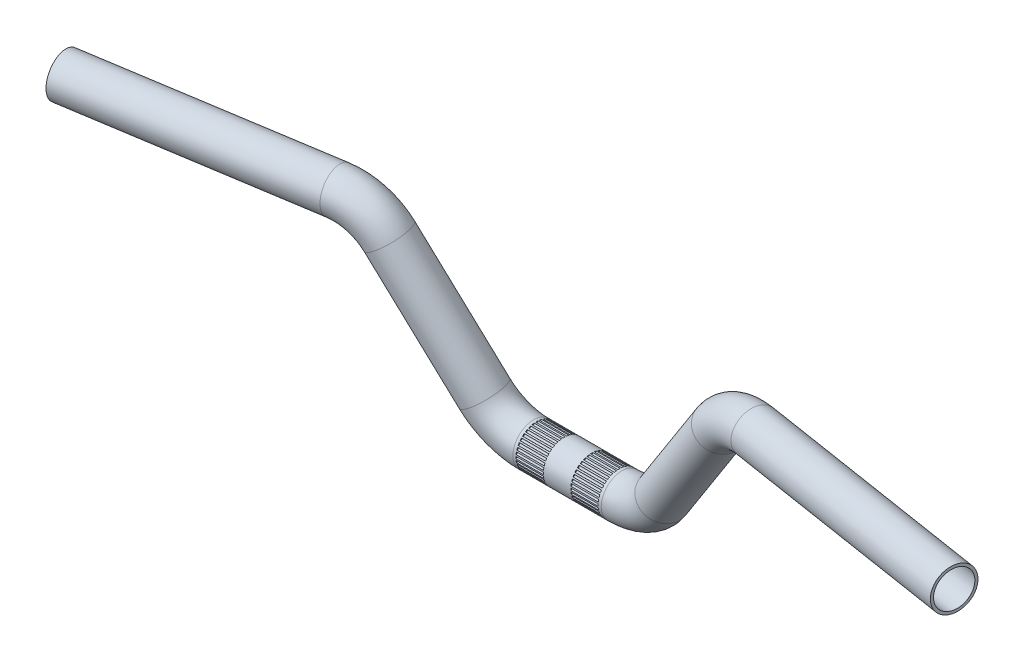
from build123d import *

# Parameters (mm, degrees)
SKETCH5_R                = 19
SKETCH5_R_2              = 16.5
CUT_EXTRUDE1_START       = -12.5
SKETCH6_R                = 1
CUT_EXTRUDE1_DEPTH       = 25
CIRPATTERN1_COUNT        = 36
MIRROR2_START            = -12.5
MIRROR2_COPY_1_SKETCH_R  = 1
MIRROR2_COPY_1_DEPTH     = 25
MIRROR2_COPY_2_SKETCH_R  = 1
MIRROR2_COPY_2_DEPTH     = 25
MIRROR2_COPY_3_SKETCH_R  = 1
MIRROR2_COPY_3_DEPTH     = 25
MIRROR2_COPY_4_SKETCH_R  = 1
MIRROR2_COPY_4_DEPTH     = 25
MIRROR2_COPY_5_SKETCH_R  = 1
MIRROR2_COPY_5_DEPTH     = 25
MIRROR2_COPY_6_SKETCH_R  = 1
MIRROR2_COPY_6_DEPTH     = 25
MIRROR2_COPY_7_SKETCH_R  = 1
MIRROR2_COPY_7_DEPTH     = 25
MIRROR2_COPY_8_SKETCH_R  = 1
MIRROR2_COPY_8_DEPTH     = 25
MIRROR2_COPY_9_SKETCH_R  = 1
MIRROR2_COPY_9_DEPTH     = 25
MIRROR2_COPY_10_SKETCH_R = 1
MIRROR2_COPY_10_DEPTH    = 25
MIRROR2_COPY_11_SKETCH_R = 1
MIRROR2_COPY_11_DEPTH    = 25
MIRROR2_COPY_12_SKETCH_R = 1
MIRROR2_COPY_12_DEPTH    = 25
MIRROR2_COPY_13_SKETCH_R = 1
MIRROR2_COPY_13_DEPTH    = 25
MIRROR2_COPY_14_SKETCH_R = 1
MIRROR2_COPY_14_DEPTH    = 25
MIRROR2_COPY_15_SKETCH_R = 1
MIRROR2_COPY_15_DEPTH    = 25
MIRROR2_COPY_16_SKETCH_R = 1
MIRROR2_COPY_16_DEPTH    = 25
MIRROR2_COPY_17_SKETCH_R = 1
MIRROR2_COPY_17_DEPTH    = 25
MIRROR2_COPY_18_SKETCH_R = 1
MIRROR2_COPY_18_DEPTH    = 25
MIRROR2_COPY_19_SKETCH_R = 1
MIRROR2_COPY_19_DEPTH    = 25
MIRROR2_COPY_20_SKETCH_R = 1
MIRROR2_COPY_20_DEPTH    = 25
MIRROR2_COPY_21_SKETCH_R = 1
MIRROR2_COPY_21_DEPTH    = 25
MIRROR2_COPY_22_SKETCH_R = 1
MIRROR2_COPY_22_DEPTH    = 25
MIRROR2_COPY_23_SKETCH_R = 1
MIRROR2_COPY_23_DEPTH    = 25
MIRROR2_COPY_24_SKETCH_R = 1
MIRROR2_COPY_24_DEPTH    = 25
MIRROR2_COPY_25_SKETCH_R = 1
MIRROR2_COPY_25_DEPTH    = 25
MIRROR2_COPY_26_SKETCH_R = 1
MIRROR2_COPY_26_DEPTH    = 25
MIRROR2_COPY_27_SKETCH_R = 1
MIRROR2_COPY_27_DEPTH    = 25
MIRROR2_COPY_28_SKETCH_R = 1
MIRROR2_COPY_28_DEPTH    = 25
MIRROR2_COPY_29_SKETCH_R = 1
MIRROR2_COPY_29_DEPTH    = 25
MIRROR2_COPY_30_SKETCH_R = 1
MIRROR2_COPY_30_DEPTH    = 25
MIRROR2_COPY_31_SKETCH_R = 1
MIRROR2_COPY_31_DEPTH    = 25
MIRROR2_COPY_32_SKETCH_R = 1
MIRROR2_COPY_32_DEPTH    = 25
MIRROR2_COPY_33_SKETCH_R = 1
MIRROR2_COPY_33_DEPTH    = 25
MIRROR2_COPY_34_SKETCH_R = 1
MIRROR2_COPY_34_DEPTH    = 25
MIRROR2_COPY_35_SKETCH_R = 1
MIRROR2_COPY_35_DEPTH    = 25


with BuildPart() as part:
    # Sweep-Thin1: sweep along a curve in space
    with BuildLine() as sweep_thin1_path:
        Line((0, 0, 0), (40.257242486, 0, 0))
        ThreePointArc((81.352690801, 21.183952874, 3.782848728), (63.451561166, 5.616419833, 1.002932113), (40.257242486, 0, 0))
        Line((81.352690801, 21.183952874, 3.782848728), (150.430291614, 119.304592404, 21.304391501))
        ThreePointArc((190.265845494, 140, 28.98382626), (167.829257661, 134.52581433, 25.076237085), (150.430291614, 119.304592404, 21.304391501))
        Line((190.265845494, 140, 28.98382626), (406, 140, 63))
    # Sketch5 → Sweep-Thin1 (sweep)
    with BuildSketch(Plane(origin=(0, 0, 0), x_dir=(0, 0, -1), z_dir=(1, 0, 0))):
        Circle(SKETCH5_R)
        Circle(SKETCH5_R_2, mode=Mode.SUBTRACT)
    sweep_thin1 = sweep(path=sweep_thin1_path.line)

    # Mirror1: Sweep-Thin1 across plane
    add(sweep_thin1.mirror(Plane(origin=(0, 0, 0), x_dir=(0, 0, 1), z_dir=(1, 0, 0))))

    # Sketch6 → Cut-Extrude1 (cut)
    with BuildSketch(Plane(origin=(0, 0, 0), x_dir=(0, 0, -1), z_dir=(1, 0, 0)).offset(CUT_EXTRUDE1_START)):
        with Locations((0, -19)):
            Circle(SKETCH6_R)
    cut_extrude1 = extrude(amount=-CUT_EXTRUDE1_DEPTH, mode=Mode.SUBTRACT)

    # CirPattern1: Cut-Extrude1 ×36 about axis
    cirpattern1_axis = Axis((0, 0, 0), (1, 0, 0))
    for i in range(1, CIRPATTERN1_COUNT):
        add(cut_extrude1.rotate(cirpattern1_axis, i * 360 / CIRPATTERN1_COUNT), mode=Mode.SUBTRACT)

    # Mirror2: Cut-Extrude1 across plane
    add(cut_extrude1.mirror(Plane(origin=(0, 0, 0), x_dir=(0, 0, 1), z_dir=(1, 0, 0))), mode=Mode.SUBTRACT)

    # Mirror2 copy 1 sketch → Mirror2 copy 1 (cut)
    with BuildSketch(Plane(origin=(0, 0, 0), x_dir=(0, 0.17364817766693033, -0.984807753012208), z_dir=(-1, 0, 0)).offset(MIRROR2_START)):
        with Locations((0, 19)):
            Circle(MIRROR2_COPY_1_SKETCH_R)
    extrude(amount=-MIRROR2_COPY_1_DEPTH, mode=Mode.SUBTRACT)

    # Mirror2 copy 2 sketch → Mirror2 copy 2 (cut)
    with BuildSketch(Plane(origin=(0, 0, 0), x_dir=(0, 0.3420201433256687, -0.9396926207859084), z_dir=(-1, 0, 0)).offset(MIRROR2_START)):
        with Locations((0, 19)):
            Circle(MIRROR2_COPY_2_SKETCH_R)
    extrude(amount=-MIRROR2_COPY_2_DEPTH, mode=Mode.SUBTRACT)

    # Mirror2 copy 3 sketch → Mirror2 copy 3 (cut)
    with BuildSketch(Plane(origin=(0, 0, 0), x_dir=(0, 0.49999999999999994, -0.8660254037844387), z_dir=(-1, 0, 0)).offset(MIRROR2_START)):
        with Locations((0, 19)):
            Circle(MIRROR2_COPY_3_SKETCH_R)
    extrude(amount=-MIRROR2_COPY_3_DEPTH, mode=Mode.SUBTRACT)

    # Mirror2 copy 4 sketch → Mirror2 copy 4 (cut)
    with BuildSketch(Plane(origin=(0, 0, 0), x_dir=(0, 0.6427876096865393, -0.766044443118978), z_dir=(-1, 0, 0)).offset(MIRROR2_START)):
        with Locations((0, 19)):
            Circle(MIRROR2_COPY_4_SKETCH_R)
    extrude(amount=-MIRROR2_COPY_4_DEPTH, mode=Mode.SUBTRACT)

    # Mirror2 copy 5 sketch → Mirror2 copy 5 (cut)
    with BuildSketch(Plane(origin=(0, 0, 0), x_dir=(0, 0.766044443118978, -0.6427876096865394), z_dir=(-1, 0, 0)).offset(MIRROR2_START)):
        with Locations((0, 19)):
            Circle(MIRROR2_COPY_5_SKETCH_R)
    extrude(amount=-MIRROR2_COPY_5_DEPTH, mode=Mode.SUBTRACT)

    # Mirror2 copy 6 sketch → Mirror2 copy 6 (cut)
    with BuildSketch(Plane(origin=(0, 0, 0), x_dir=(0, 0.8660254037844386, -0.5000000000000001), z_dir=(-1, 0, 0)).offset(MIRROR2_START)):
        with Locations((0, 19)):
            Circle(MIRROR2_COPY_6_SKETCH_R)
    extrude(amount=-MIRROR2_COPY_6_DEPTH, mode=Mode.SUBTRACT)

    # Mirror2 copy 7 sketch → Mirror2 copy 7 (cut)
    with BuildSketch(Plane(origin=(0, 0, 0), x_dir=(0, 0.9396926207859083, -0.3420201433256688), z_dir=(-1, 0, 0)).offset(MIRROR2_START)):
        with Locations((0, 19)):
            Circle(MIRROR2_COPY_7_SKETCH_R)
    extrude(amount=-MIRROR2_COPY_7_DEPTH, mode=Mode.SUBTRACT)

    # Mirror2 copy 8 sketch → Mirror2 copy 8 (cut)
    with BuildSketch(Plane(origin=(0, 0, 0), x_dir=(0, 0.984807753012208, -0.17364817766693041), z_dir=(-1, 0, 0)).offset(MIRROR2_START)):
        with Locations((0, 19)):
            Circle(MIRROR2_COPY_8_SKETCH_R)
    extrude(amount=-MIRROR2_COPY_8_DEPTH, mode=Mode.SUBTRACT)

    # Mirror2 copy 9 sketch → Mirror2 copy 9 (cut)
    with BuildSketch(Plane(origin=(0, 0, 0), x_dir=(0, 1, 0), z_dir=(-1, 0, 0)).offset(MIRROR2_START)):
        with Locations((0, 19)):
            Circle(MIRROR2_COPY_9_SKETCH_R)
    extrude(amount=-MIRROR2_COPY_9_DEPTH, mode=Mode.SUBTRACT)

    # Mirror2 copy 10 sketch → Mirror2 copy 10 (cut)
    with BuildSketch(Plane(origin=(0, 0, 0), x_dir=(0, 0.984807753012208, 0.1736481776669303), z_dir=(-1, 0, 0)).offset(MIRROR2_START)):
        with Locations((0, 19)):
            Circle(MIRROR2_COPY_10_SKETCH_R)
    extrude(amount=-MIRROR2_COPY_10_DEPTH, mode=Mode.SUBTRACT)

    # Mirror2 copy 11 sketch → Mirror2 copy 11 (cut)
    with BuildSketch(Plane(origin=(0, 0, 0), x_dir=(0, 0.9396926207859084, 0.3420201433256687), z_dir=(-1, 0, 0)).offset(MIRROR2_START)):
        with Locations((0, 19)):
            Circle(MIRROR2_COPY_11_SKETCH_R)
    extrude(amount=-MIRROR2_COPY_11_DEPTH, mode=Mode.SUBTRACT)

    # Mirror2 copy 12 sketch → Mirror2 copy 12 (cut)
    with BuildSketch(Plane(origin=(0, 0, 0), x_dir=(0, 0.8660254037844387, 0.4999999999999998), z_dir=(-1, 0, 0)).offset(MIRROR2_START)):
        with Locations((0, 19)):
            Circle(MIRROR2_COPY_12_SKETCH_R)
    extrude(amount=-MIRROR2_COPY_12_DEPTH, mode=Mode.SUBTRACT)

    # Mirror2 copy 13 sketch → Mirror2 copy 13 (cut)
    with BuildSketch(Plane(origin=(0, 0, 0), x_dir=(0, 0.766044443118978, 0.6427876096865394), z_dir=(-1, 0, 0)).offset(MIRROR2_START)):
        with Locations((0, 19)):
            Circle(MIRROR2_COPY_13_SKETCH_R)
    extrude(amount=-MIRROR2_COPY_13_DEPTH, mode=Mode.SUBTRACT)

    # Mirror2 copy 14 sketch → Mirror2 copy 14 (cut)
    with BuildSketch(Plane(origin=(0, 0, 0), x_dir=(0, 0.6427876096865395, 0.7660444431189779), z_dir=(-1, 0, 0)).offset(MIRROR2_START)):
        with Locations((0, 19)):
            Circle(MIRROR2_COPY_14_SKETCH_R)
    extrude(amount=-MIRROR2_COPY_14_DEPTH, mode=Mode.SUBTRACT)

    # Mirror2 copy 15 sketch → Mirror2 copy 15 (cut)
    with BuildSketch(Plane(origin=(0, 0, 0), x_dir=(0, 0.49999999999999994, 0.8660254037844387), z_dir=(-1, 0, 0)).offset(MIRROR2_START)):
        with Locations((0, 19)):
            Circle(MIRROR2_COPY_15_SKETCH_R)
    extrude(amount=-MIRROR2_COPY_15_DEPTH, mode=Mode.SUBTRACT)

    # Mirror2 copy 16 sketch → Mirror2 copy 16 (cut)
    with BuildSketch(Plane(origin=(0, 0, 0), x_dir=(0, 0.3420201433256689, 0.9396926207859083), z_dir=(-1, 0, 0)).offset(MIRROR2_START)):
        with Locations((0, 19)):
            Circle(MIRROR2_COPY_16_SKETCH_R)
    extrude(amount=-MIRROR2_COPY_16_DEPTH, mode=Mode.SUBTRACT)

    # Mirror2 copy 17 sketch → Mirror2 copy 17 (cut)
    with BuildSketch(Plane(origin=(0, 0, 0), x_dir=(0, 0.17364817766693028, 0.984807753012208), z_dir=(-1, 0, 0)).offset(MIRROR2_START)):
        with Locations((0, 19)):
            Circle(MIRROR2_COPY_17_SKETCH_R)
    extrude(amount=-MIRROR2_COPY_17_DEPTH, mode=Mode.SUBTRACT)

    # Mirror2 copy 18 sketch → Mirror2 copy 18 (cut)
    with BuildSketch(Plane.ZY.offset(MIRROR2_START)):
        with Locations((0, 19)):
            Circle(MIRROR2_COPY_18_SKETCH_R)
    extrude(amount=-MIRROR2_COPY_18_DEPTH, mode=Mode.SUBTRACT)

    # Mirror2 copy 19 sketch → Mirror2 copy 19 (cut)
    with BuildSketch(Plane(origin=(0, 0, 0), x_dir=(0, -0.17364817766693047, 0.984807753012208), z_dir=(-1, 0, 0)).offset(MIRROR2_START)):
        with Locations((0, 19)):
            Circle(MIRROR2_COPY_19_SKETCH_R)
    extrude(amount=-MIRROR2_COPY_19_DEPTH, mode=Mode.SUBTRACT)

    # Mirror2 copy 20 sketch → Mirror2 copy 20 (cut)
    with BuildSketch(Plane(origin=(0, 0, 0), x_dir=(0, -0.34202014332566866, 0.9396926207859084), z_dir=(-1, 0, 0)).offset(MIRROR2_START)):
        with Locations((0, 19)):
            Circle(MIRROR2_COPY_20_SKETCH_R)
    extrude(amount=-MIRROR2_COPY_20_DEPTH, mode=Mode.SUBTRACT)

    # Mirror2 copy 21 sketch → Mirror2 copy 21 (cut)
    with BuildSketch(Plane(origin=(0, 0, 0), x_dir=(0, -0.5000000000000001, 0.8660254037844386), z_dir=(-1, 0, 0)).offset(MIRROR2_START)):
        with Locations((0, 19)):
            Circle(MIRROR2_COPY_21_SKETCH_R)
    extrude(amount=-MIRROR2_COPY_21_DEPTH, mode=Mode.SUBTRACT)

    # Mirror2 copy 22 sketch → Mirror2 copy 22 (cut)
    with BuildSketch(Plane(origin=(0, 0, 0), x_dir=(0, -0.6427876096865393, 0.766044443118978), z_dir=(-1, 0, 0)).offset(MIRROR2_START)):
        with Locations((0, 19)):
            Circle(MIRROR2_COPY_22_SKETCH_R)
    extrude(amount=-MIRROR2_COPY_22_DEPTH, mode=Mode.SUBTRACT)

    # Mirror2 copy 23 sketch → Mirror2 copy 23 (cut)
    with BuildSketch(Plane(origin=(0, 0, 0), x_dir=(0, -0.7660444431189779, 0.6427876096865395), z_dir=(-1, 0, 0)).offset(MIRROR2_START)):
        with Locations((0, 19)):
            Circle(MIRROR2_COPY_23_SKETCH_R)
    extrude(amount=-MIRROR2_COPY_23_DEPTH, mode=Mode.SUBTRACT)

    # Mirror2 copy 24 sketch → Mirror2 copy 24 (cut)
    with BuildSketch(Plane(origin=(0, 0, 0), x_dir=(0, -0.8660254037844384, 0.5000000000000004), z_dir=(-1, 0, 0)).offset(MIRROR2_START)):
        with Locations((0, 19)):
            Circle(MIRROR2_COPY_24_SKETCH_R)
    extrude(amount=-MIRROR2_COPY_24_DEPTH, mode=Mode.SUBTRACT)

    # Mirror2 copy 25 sketch → Mirror2 copy 25 (cut)
    with BuildSketch(Plane(origin=(0, 0, 0), x_dir=(0, -0.9396926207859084, 0.34202014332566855), z_dir=(-1, 0, 0)).offset(MIRROR2_START)):
        with Locations((0, 19)):
            Circle(MIRROR2_COPY_25_SKETCH_R)
    extrude(amount=-MIRROR2_COPY_25_DEPTH, mode=Mode.SUBTRACT)

    # Mirror2 copy 26 sketch → Mirror2 copy 26 (cut)
    with BuildSketch(Plane(origin=(0, 0, 0), x_dir=(0, -0.984807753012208, 0.17364817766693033), z_dir=(-1, 0, 0)).offset(MIRROR2_START)):
        with Locations((0, 19)):
            Circle(MIRROR2_COPY_26_SKETCH_R)
    extrude(amount=-MIRROR2_COPY_26_DEPTH, mode=Mode.SUBTRACT)

    # Mirror2 copy 27 sketch → Mirror2 copy 27 (cut)
    with BuildSketch(Plane(origin=(0, 0, 0), x_dir=(0, -1, 0), z_dir=(-1, 0, 0)).offset(MIRROR2_START)):
        with Locations((0, 19)):
            Circle(MIRROR2_COPY_27_SKETCH_R)
    extrude(amount=-MIRROR2_COPY_27_DEPTH, mode=Mode.SUBTRACT)

    # Mirror2 copy 28 sketch → Mirror2 copy 28 (cut)
    with BuildSketch(Plane(origin=(0, 0, 0), x_dir=(0, -0.9848077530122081, -0.17364817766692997), z_dir=(-1, 0, 0)).offset(MIRROR2_START)):
        with Locations((0, 19)):
            Circle(MIRROR2_COPY_28_SKETCH_R)
    extrude(amount=-MIRROR2_COPY_28_DEPTH, mode=Mode.SUBTRACT)

    # Mirror2 copy 29 sketch → Mirror2 copy 29 (cut)
    with BuildSketch(Plane(origin=(0, 0, 0), x_dir=(0, -0.9396926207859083, -0.342020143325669), z_dir=(-1, 0, 0)).offset(MIRROR2_START)):
        with Locations((0, 19)):
            Circle(MIRROR2_COPY_29_SKETCH_R)
    extrude(amount=-MIRROR2_COPY_29_DEPTH, mode=Mode.SUBTRACT)

    # Mirror2 copy 30 sketch → Mirror2 copy 30 (cut)
    with BuildSketch(Plane(origin=(0, 0, 0), x_dir=(0, -0.8660254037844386, -0.5000000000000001), z_dir=(-1, 0, 0)).offset(MIRROR2_START)):
        with Locations((0, 19)):
            Circle(MIRROR2_COPY_30_SKETCH_R)
    extrude(amount=-MIRROR2_COPY_30_DEPTH, mode=Mode.SUBTRACT)

    # Mirror2 copy 31 sketch → Mirror2 copy 31 (cut)
    with BuildSketch(Plane(origin=(0, 0, 0), x_dir=(0, -0.7660444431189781, -0.6427876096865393), z_dir=(-1, 0, 0)).offset(MIRROR2_START)):
        with Locations((0, 19)):
            Circle(MIRROR2_COPY_31_SKETCH_R)
    extrude(amount=-MIRROR2_COPY_31_DEPTH, mode=Mode.SUBTRACT)

    # Mirror2 copy 32 sketch → Mirror2 copy 32 (cut)
    with BuildSketch(Plane(origin=(0, 0, 0), x_dir=(0, -0.6427876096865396, -0.7660444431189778), z_dir=(-1, 0, 0)).offset(MIRROR2_START)):
        with Locations((0, 19)):
            Circle(MIRROR2_COPY_32_SKETCH_R)
    extrude(amount=-MIRROR2_COPY_32_DEPTH, mode=Mode.SUBTRACT)

    # Mirror2 copy 33 sketch → Mirror2 copy 33 (cut)
    with BuildSketch(Plane(origin=(0, 0, 0), x_dir=(0, -0.5000000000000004, -0.8660254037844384), z_dir=(-1, 0, 0)).offset(MIRROR2_START)):
        with Locations((0, 19)):
            Circle(MIRROR2_COPY_33_SKETCH_R)
    extrude(amount=-MIRROR2_COPY_33_DEPTH, mode=Mode.SUBTRACT)

    # Mirror2 copy 34 sketch → Mirror2 copy 34 (cut)
    with BuildSketch(Plane(origin=(0, 0, 0), x_dir=(0, -0.3420201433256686, -0.9396926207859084), z_dir=(-1, 0, 0)).offset(MIRROR2_START)):
        with Locations((0, 19)):
            Circle(MIRROR2_COPY_34_SKETCH_R)
    extrude(amount=-MIRROR2_COPY_34_DEPTH, mode=Mode.SUBTRACT)

    # Mirror2 copy 35 sketch → Mirror2 copy 35 (cut)
    with BuildSketch(Plane(origin=(0, 0, 0), x_dir=(0, -0.1736481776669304, -0.984807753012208), z_dir=(-1, 0, 0)).offset(MIRROR2_START)):
        with Locations((0, 19)):
            Circle(MIRROR2_COPY_35_SKETCH_R)
    extrude(amount=-MIRROR2_COPY_35_DEPTH, mode=Mode.SUBTRACT)


solid = part.part
